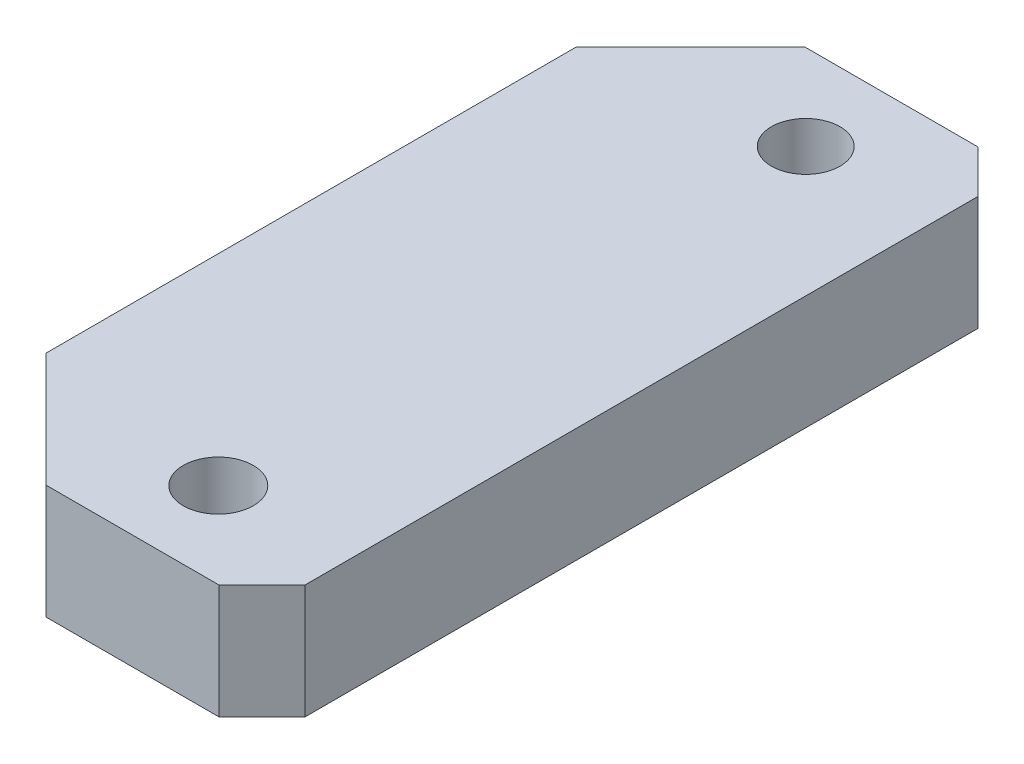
ISO-10303-21;
HEADER;
FILE_DESCRIPTION(('STEP AP214'),'2;1');
FILE_NAME('part.step','',(''),(''),'','','');
FILE_SCHEMA(('AUTOMOTIVE_DESIGN { 1 0 10303 214 1 1 1 1 }'));
ENDSEC;
DATA;
#1=APPLICATION_CONTEXT('core data for automotive mechanical design processes');
#2=APPLICATION_PROTOCOL_DEFINITION('international standard','automotive_design',2000,#1);
#3=PRODUCT_CONTEXT('',#1,'mechanical');
#4=PRODUCT('Part','Part','',(#3));
#5=PRODUCT_RELATED_PRODUCT_CATEGORY('part','',(#4));
#6=PRODUCT_DEFINITION_FORMATION('','',#4);
#7=PRODUCT_DEFINITION_CONTEXT('part definition',#1,'design');
#8=PRODUCT_DEFINITION('design','',#6,#7);
#9=PRODUCT_DEFINITION_SHAPE('','',#8);
#10=(LENGTH_UNIT() NAMED_UNIT(*) SI_UNIT(.MILLI.,.METRE.));
#11=(NAMED_UNIT(*) PLANE_ANGLE_UNIT() SI_UNIT($,.RADIAN.));
#12=(NAMED_UNIT(*) SI_UNIT($,.STERADIAN.) SOLID_ANGLE_UNIT());
#13=UNCERTAINTY_MEASURE_WITH_UNIT(LENGTH_MEASURE(1.E-05),#10,'distance_accuracy_value','');
#14=(GEOMETRIC_REPRESENTATION_CONTEXT(3) GLOBAL_UNCERTAINTY_ASSIGNED_CONTEXT((#13)) GLOBAL_UNIT_ASSIGNED_CONTEXT((#10,
#11,#12)) REPRESENTATION_CONTEXT('',''));
#15=CARTESIAN_POINT('',(0.,0.,0.));
#16=DIRECTION('',(0.,0.,1.));
#17=DIRECTION('',(1.,0.,0.));
#18=AXIS2_PLACEMENT_3D('',#15,#16,#17);
#19=CARTESIAN_POINT('',(-37.72,-4.,-13.28));
#20=DIRECTION('',(0.,0.,-1.));
#21=DIRECTION('',(-1.,0.,0.));
#22=AXIS2_PLACEMENT_3D('',#19,#20,#21);
#23=PLANE('',#22);
#24=DIRECTION('',(-1.,0.,0.));
#25=VECTOR('',#24,1.);
#26=CARTESIAN_POINT('',(-37.72,0.,-13.28));
#27=LINE('',#26,#25);
#28=CARTESIAN_POINT('',(-37.72,0.,-13.28));
#29=VERTEX_POINT('',#28);
#30=CARTESIAN_POINT('',(-43.78,0.,-13.28));
#31=VERTEX_POINT('',#30);
#32=EDGE_CURVE('E130',#29,#31,#27,.T.);
#33=ORIENTED_EDGE('',*,*,#32,.F.);
#34=DIRECTION('',(0.,1.,0.));
#35=VECTOR('',#34,1.);
#36=CARTESIAN_POINT('',(-37.72,-4.,-13.28));
#37=LINE('',#36,#35);
#38=CARTESIAN_POINT('',(-37.72,-4.,-13.28));
#39=VERTEX_POINT('',#38);
#40=EDGE_CURVE('E11',#39,#29,#37,.T.);
#41=ORIENTED_EDGE('',*,*,#40,.F.);
#42=DIRECTION('',(-1.,0.,0.));
#43=VECTOR('',#42,1.);
#44=CARTESIAN_POINT('',(-37.72,-4.,-13.28));
#45=LINE('',#44,#43);
#46=CARTESIAN_POINT('',(-43.78,-4.,-13.28));
#47=VERTEX_POINT('',#46);
#48=EDGE_CURVE('E151',#39,#47,#45,.T.);
#49=ORIENTED_EDGE('',*,*,#48,.T.);
#50=DIRECTION('',(0.,1.,0.));
#51=VECTOR('',#50,1.);
#52=CARTESIAN_POINT('',(-43.78,-4.,-13.28));
#53=LINE('',#52,#51);
#54=EDGE_CURVE('E36',#47,#31,#53,.T.);
#55=ORIENTED_EDGE('',*,*,#54,.T.);
#56=EDGE_LOOP('',(#33,#41,#49,#55));
#57=FACE_BOUND('',#56,.T.);
#58=ADVANCED_FACE('F33',(#57),#23,.T.);
#59=CARTESIAN_POINT('',(-36.22,-4.,-11.78));
#60=DIRECTION('',(0.707106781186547,0.,-0.707106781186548));
#61=DIRECTION('',(-0.707106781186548,0.,-0.707106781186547));
#62=AXIS2_PLACEMENT_3D('',#59,#60,#61);
#63=PLANE('',#62);
#64=DIRECTION('',(-0.707106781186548,0.,-0.707106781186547));
#65=VECTOR('',#64,1.);
#66=CARTESIAN_POINT('',(-36.22,0.,-11.78));
#67=LINE('',#66,#65);
#68=CARTESIAN_POINT('',(-36.22,0.,-11.78));
#69=VERTEX_POINT('',#68);
#70=EDGE_CURVE('E149',#69,#29,#67,.T.);
#71=ORIENTED_EDGE('',*,*,#70,.F.);
#72=DIRECTION('',(0.,1.,0.));
#73=VECTOR('',#72,1.);
#74=CARTESIAN_POINT('',(-36.22,-4.,-11.78));
#75=LINE('',#74,#73);
#76=CARTESIAN_POINT('',(-36.22,-4.,-11.78));
#77=VERTEX_POINT('',#76);
#78=EDGE_CURVE('E42',#77,#69,#75,.T.);
#79=ORIENTED_EDGE('',*,*,#78,.F.);
#80=DIRECTION('',(-0.707106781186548,0.,-0.707106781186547));
#81=VECTOR('',#80,1.);
#82=CARTESIAN_POINT('',(-36.22,-4.,-11.78));
#83=LINE('',#82,#81);
#84=EDGE_CURVE('E120',#77,#39,#83,.T.);
#85=ORIENTED_EDGE('',*,*,#84,.T.);
#86=ORIENTED_EDGE('',*,*,#40,.T.);
#87=EDGE_LOOP('',(#71,#79,#85,#86));
#88=FACE_BOUND('',#87,.T.);
#89=ADVANCED_FACE('F163',(#88),#63,.T.);
#90=CARTESIAN_POINT('',(-36.22,-4.,11.78));
#91=DIRECTION('',(1.,0.,0.));
#92=DIRECTION('',(0.,0.,-1.));
#93=AXIS2_PLACEMENT_3D('',#90,#91,#92);
#94=PLANE('',#93);
#95=DIRECTION('',(0.,0.,-1.));
#96=VECTOR('',#95,1.);
#97=CARTESIAN_POINT('',(-36.22,0.,11.78));
#98=LINE('',#97,#96);
#99=CARTESIAN_POINT('',(-36.22,0.,11.78));
#100=VERTEX_POINT('',#99);
#101=EDGE_CURVE('E107',#100,#69,#98,.T.);
#102=ORIENTED_EDGE('',*,*,#101,.F.);
#103=DIRECTION('',(0.,1.,0.));
#104=VECTOR('',#103,1.);
#105=CARTESIAN_POINT('',(-36.22,-4.,11.78));
#106=LINE('',#105,#104);
#107=CARTESIAN_POINT('',(-36.22,-4.,11.78));
#108=VERTEX_POINT('',#107);
#109=EDGE_CURVE('E102',#108,#100,#106,.T.);
#110=ORIENTED_EDGE('',*,*,#109,.F.);
#111=DIRECTION('',(0.,0.,-1.));
#112=VECTOR('',#111,1.);
#113=CARTESIAN_POINT('',(-36.22,-4.,11.78));
#114=LINE('',#113,#112);
#115=EDGE_CURVE('E105',#108,#77,#114,.T.);
#116=ORIENTED_EDGE('',*,*,#115,.T.);
#117=ORIENTED_EDGE('',*,*,#78,.T.);
#118=EDGE_LOOP('',(#102,#110,#116,#117));
#119=FACE_BOUND('',#118,.T.);
#120=ADVANCED_FACE('F104',(#119),#94,.T.);
#121=CARTESIAN_POINT('',(-37.72,-4.,13.28));
#122=DIRECTION('',(0.707106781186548,0.,0.707106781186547));
#123=DIRECTION('',(0.707106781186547,0.,-0.707106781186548));
#124=AXIS2_PLACEMENT_3D('',#121,#122,#123);
#125=PLANE('',#124);
#126=DIRECTION('',(0.707106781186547,0.,-0.707106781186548));
#127=VECTOR('',#126,1.);
#128=CARTESIAN_POINT('',(-37.72,0.,13.28));
#129=LINE('',#128,#127);
#130=CARTESIAN_POINT('',(-37.72,0.,13.28));
#131=VERTEX_POINT('',#130);
#132=EDGE_CURVE('E146',#131,#100,#129,.T.);
#133=ORIENTED_EDGE('',*,*,#132,.F.);
#134=DIRECTION('',(0.,1.,0.));
#135=VECTOR('',#134,1.);
#136=CARTESIAN_POINT('',(-37.72,-4.,13.28));
#137=LINE('',#136,#135);
#138=CARTESIAN_POINT('',(-37.72,-4.,13.28));
#139=VERTEX_POINT('',#138);
#140=EDGE_CURVE('E112',#139,#131,#137,.T.);
#141=ORIENTED_EDGE('',*,*,#140,.F.);
#142=DIRECTION('',(0.707106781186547,0.,-0.707106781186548));
#143=VECTOR('',#142,1.);
#144=CARTESIAN_POINT('',(-37.72,-4.,13.28));
#145=LINE('',#144,#143);
#146=EDGE_CURVE('E118',#139,#108,#145,.T.);
#147=ORIENTED_EDGE('',*,*,#146,.T.);
#148=ORIENTED_EDGE('',*,*,#109,.T.);
#149=EDGE_LOOP('',(#133,#141,#147,#148));
#150=FACE_BOUND('',#149,.T.);
#151=ADVANCED_FACE('F122',(#150),#125,.T.);
#152=CARTESIAN_POINT('',(-37.72,-4.,13.28));
#153=DIRECTION('',(0.,0.,1.));
#154=DIRECTION('',(1.,0.,0.));
#155=AXIS2_PLACEMENT_3D('',#152,#153,#154);
#156=PLANE('',#155);
#157=DIRECTION('',(1.,0.,0.));
#158=VECTOR('',#157,1.);
#159=CARTESIAN_POINT('',(-37.72,0.,13.28));
#160=LINE('',#159,#158);
#161=CARTESIAN_POINT('',(-43.78,0.,13.28));
#162=VERTEX_POINT('',#161);
#163=EDGE_CURVE('E143',#162,#131,#160,.T.);
#164=ORIENTED_EDGE('',*,*,#163,.F.);
#165=DIRECTION('',(0.,1.,0.));
#166=VECTOR('',#165,1.);
#167=CARTESIAN_POINT('',(-43.78,-4.,13.28));
#168=LINE('',#167,#166);
#169=CARTESIAN_POINT('',(-43.78,-4.,13.28));
#170=VERTEX_POINT('',#169);
#171=EDGE_CURVE('E155',#170,#162,#168,.T.);
#172=ORIENTED_EDGE('',*,*,#171,.F.);
#173=DIRECTION('',(1.,0.,0.));
#174=VECTOR('',#173,1.);
#175=CARTESIAN_POINT('',(-37.72,-4.,13.28));
#176=LINE('',#175,#174);
#177=EDGE_CURVE('E123',#170,#139,#176,.T.);
#178=ORIENTED_EDGE('',*,*,#177,.T.);
#179=ORIENTED_EDGE('',*,*,#140,.T.);
#180=EDGE_LOOP('',(#164,#172,#178,#179));
#181=FACE_BOUND('',#180,.T.);
#182=ADVANCED_FACE('F176',(#181),#156,.T.);
#183=CARTESIAN_POINT('',(-43.78,-4.,13.28));
#184=DIRECTION('',(-0.707106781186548,0.,0.707106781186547));
#185=DIRECTION('',(0.707106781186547,0.,0.707106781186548));
#186=AXIS2_PLACEMENT_3D('',#183,#184,#185);
#187=PLANE('',#186);
#188=DIRECTION('',(0.707106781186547,0.,0.707106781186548));
#189=VECTOR('',#188,1.);
#190=CARTESIAN_POINT('',(-43.78,0.,13.28));
#191=LINE('',#190,#189);
#192=CARTESIAN_POINT('',(-47.78,0.,9.28000000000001));
#193=VERTEX_POINT('',#192);
#194=EDGE_CURVE('E140',#193,#162,#191,.T.);
#195=ORIENTED_EDGE('',*,*,#194,.F.);
#196=DIRECTION('',(0.,1.,0.));
#197=VECTOR('',#196,1.);
#198=CARTESIAN_POINT('',(-47.78,-4.,9.28000000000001));
#199=LINE('',#198,#197);
#200=CARTESIAN_POINT('',(-47.78,-4.,9.28000000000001));
#201=VERTEX_POINT('',#200);
#202=EDGE_CURVE('E157',#201,#193,#199,.T.);
#203=ORIENTED_EDGE('',*,*,#202,.F.);
#204=DIRECTION('',(0.707106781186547,0.,0.707106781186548));
#205=VECTOR('',#204,1.);
#206=CARTESIAN_POINT('',(-43.78,-4.,13.28));
#207=LINE('',#206,#205);
#208=EDGE_CURVE('E125',#201,#170,#207,.T.);
#209=ORIENTED_EDGE('',*,*,#208,.T.);
#210=ORIENTED_EDGE('',*,*,#171,.T.);
#211=EDGE_LOOP('',(#195,#203,#209,#210));
#212=FACE_BOUND('',#211,.T.);
#213=ADVANCED_FACE('F179',(#212),#187,.T.);
#214=CARTESIAN_POINT('',(-47.78,-4.,9.28000000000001));
#215=DIRECTION('',(-1.,0.,0.));
#216=DIRECTION('',(0.,0.,1.));
#217=AXIS2_PLACEMENT_3D('',#214,#215,#216);
#218=PLANE('',#217);
#219=DIRECTION('',(0.,0.,1.));
#220=VECTOR('',#219,1.);
#221=CARTESIAN_POINT('',(-47.78,0.,9.28000000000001));
#222=LINE('',#221,#220);
#223=CARTESIAN_POINT('',(-47.78,0.,-9.28000000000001));
#224=VERTEX_POINT('',#223);
#225=EDGE_CURVE('E137',#224,#193,#222,.T.);
#226=ORIENTED_EDGE('',*,*,#225,.F.);
#227=DIRECTION('',(0.,1.,0.));
#228=VECTOR('',#227,1.);
#229=CARTESIAN_POINT('',(-47.78,-4.,-9.28000000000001));
#230=LINE('',#229,#228);
#231=CARTESIAN_POINT('',(-47.78,-4.,-9.28000000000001));
#232=VERTEX_POINT('',#231);
#233=EDGE_CURVE('E158',#232,#224,#230,.T.);
#234=ORIENTED_EDGE('',*,*,#233,.F.);
#235=DIRECTION('',(0.,0.,1.));
#236=VECTOR('',#235,1.);
#237=CARTESIAN_POINT('',(-47.78,-4.,9.28000000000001));
#238=LINE('',#237,#236);
#239=EDGE_CURVE('E225',#232,#201,#238,.T.);
#240=ORIENTED_EDGE('',*,*,#239,.T.);
#241=ORIENTED_EDGE('',*,*,#202,.T.);
#242=EDGE_LOOP('',(#226,#234,#240,#241));
#243=FACE_BOUND('',#242,.T.);
#244=ADVANCED_FACE('F183',(#243),#218,.T.);
#245=CARTESIAN_POINT('',(-47.78,-4.,-9.28000000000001));
#246=DIRECTION('',(-0.707106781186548,0.,-0.707106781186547));
#247=DIRECTION('',(-0.707106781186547,0.,0.707106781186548));
#248=AXIS2_PLACEMENT_3D('',#245,#246,#247);
#249=PLANE('',#248);
#250=DIRECTION('',(-0.707106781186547,0.,0.707106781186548));
#251=VECTOR('',#250,1.);
#252=CARTESIAN_POINT('',(-47.78,0.,-9.28000000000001));
#253=LINE('',#252,#251);
#254=EDGE_CURVE('E133',#31,#224,#253,.T.);
#255=ORIENTED_EDGE('',*,*,#254,.F.);
#256=ORIENTED_EDGE('',*,*,#54,.F.);
#257=DIRECTION('',(-0.707106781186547,0.,0.707106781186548));
#258=VECTOR('',#257,1.);
#259=CARTESIAN_POINT('',(-47.78,-4.,-9.28000000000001));
#260=LINE('',#259,#258);
#261=EDGE_CURVE('E223',#47,#232,#260,.T.);
#262=ORIENTED_EDGE('',*,*,#261,.T.);
#263=ORIENTED_EDGE('',*,*,#233,.T.);
#264=EDGE_LOOP('',(#255,#256,#262,#263));
#265=FACE_BOUND('',#264,.T.);
#266=ADVANCED_FACE('F160',(#265),#249,.T.);
#267=CARTESIAN_POINT('',(0.,-4.,0.));
#268=DIRECTION('',(0.,-1.,0.));
#269=DIRECTION('',(0.,0.,-1.));
#270=AXIS2_PLACEMENT_3D('',#267,#268,#269);
#271=PLANE('',#270);
#272=CARTESIAN_POINT('',(-40.75,-4.,-10.28));
#273=DIRECTION('',(0.,1.,0.));
#274=DIRECTION('',(0.,0.,1.));
#275=AXIS2_PLACEMENT_3D('',#272,#273,#274);
#276=CIRCLE('',#275,1.2);
#277=CARTESIAN_POINT('',(-40.75,-4.,-9.08000000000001));
#278=VERTEX_POINT('',#277);
#279=EDGE_CURVE('E210',#278,#278,#276,.T.);
#280=ORIENTED_EDGE('',*,*,#279,.T.);
#281=EDGE_LOOP('',(#280));
#282=FACE_BOUND('',#281,.T.);
#283=CARTESIAN_POINT('',(-40.75,-4.,10.28));
#284=DIRECTION('',(0.,1.,0.));
#285=DIRECTION('',(0.,0.,1.));
#286=AXIS2_PLACEMENT_3D('',#283,#284,#285);
#287=CIRCLE('',#286,1.22549312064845);
#288=CARTESIAN_POINT('',(-40.75,-4.,11.5054931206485));
#289=VERTEX_POINT('',#288);
#290=EDGE_CURVE('E134',#289,#289,#287,.T.);
#291=ORIENTED_EDGE('',*,*,#290,.T.);
#292=EDGE_LOOP('',(#291));
#293=FACE_BOUND('',#292,.T.);
#294=ORIENTED_EDGE('',*,*,#48,.F.);
#295=ORIENTED_EDGE('',*,*,#84,.F.);
#296=ORIENTED_EDGE('',*,*,#115,.F.);
#297=ORIENTED_EDGE('',*,*,#146,.F.);
#298=ORIENTED_EDGE('',*,*,#177,.F.);
#299=ORIENTED_EDGE('',*,*,#208,.F.);
#300=ORIENTED_EDGE('',*,*,#239,.F.);
#301=ORIENTED_EDGE('',*,*,#261,.F.);
#302=EDGE_LOOP('',(#294,#295,#296,#297,#298,#299,#300,#301));
#303=FACE_BOUND('',#302,.T.);
#304=ADVANCED_FACE('F116',(#282,#293,#303),#271,.T.);
#305=CARTESIAN_POINT('',(0.,0.,0.));
#306=DIRECTION('',(0.,-1.,0.));
#307=DIRECTION('',(0.,0.,-1.));
#308=AXIS2_PLACEMENT_3D('',#305,#306,#307);
#309=PLANE('',#308);
#310=CARTESIAN_POINT('',(-40.75,0.,-10.28));
#311=DIRECTION('',(0.,1.,0.));
#312=DIRECTION('',(0.,0.,1.));
#313=AXIS2_PLACEMENT_3D('',#310,#311,#312);
#314=CIRCLE('',#313,1.2);
#315=CARTESIAN_POINT('',(-40.75,0.,-9.08000000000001));
#316=VERTEX_POINT('',#315);
#317=EDGE_CURVE('E213',#316,#316,#314,.T.);
#318=ORIENTED_EDGE('',*,*,#317,.F.);
#319=EDGE_LOOP('',(#318));
#320=FACE_BOUND('',#319,.T.);
#321=CARTESIAN_POINT('',(-40.75,0.,10.28));
#322=DIRECTION('',(0.,1.,0.));
#323=DIRECTION('',(0.,0.,1.));
#324=AXIS2_PLACEMENT_3D('',#321,#322,#323);
#325=CIRCLE('',#324,1.22549312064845);
#326=CARTESIAN_POINT('',(-40.75,0.,11.5054931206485));
#327=VERTEX_POINT('',#326);
#328=EDGE_CURVE('E215',#327,#327,#325,.T.);
#329=ORIENTED_EDGE('',*,*,#328,.F.);
#330=EDGE_LOOP('',(#329));
#331=FACE_BOUND('',#330,.T.);
#332=ORIENTED_EDGE('',*,*,#32,.T.);
#333=ORIENTED_EDGE('',*,*,#254,.T.);
#334=ORIENTED_EDGE('',*,*,#225,.T.);
#335=ORIENTED_EDGE('',*,*,#194,.T.);
#336=ORIENTED_EDGE('',*,*,#163,.T.);
#337=ORIENTED_EDGE('',*,*,#132,.T.);
#338=ORIENTED_EDGE('',*,*,#101,.T.);
#339=ORIENTED_EDGE('',*,*,#70,.T.);
#340=EDGE_LOOP('',(#332,#333,#334,#335,#336,#337,#338,#339));
#341=FACE_BOUND('',#340,.T.);
#342=ADVANCED_FACE('F162',(#320,#331,#341),#309,.F.);
#343=CARTESIAN_POINT('',(-40.75,-4.,10.28));
#344=DIRECTION('',(0.,1.,0.));
#345=DIRECTION('',(0.,0.,1.));
#346=AXIS2_PLACEMENT_3D('',#343,#344,#345);
#347=CYLINDRICAL_SURFACE('',#346,1.22549312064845);
#348=ORIENTED_EDGE('',*,*,#290,.F.);
#349=EDGE_LOOP('',(#348));
#350=FACE_BOUND('',#349,.T.);
#351=ORIENTED_EDGE('',*,*,#328,.T.);
#352=EDGE_LOOP('',(#351));
#353=FACE_BOUND('',#352,.T.);
#354=ADVANCED_FACE('F195',(#350,#353),#347,.F.);
#355=CARTESIAN_POINT('',(-40.75,-4.,-10.28));
#356=DIRECTION('',(0.,1.,0.));
#357=DIRECTION('',(0.,0.,1.));
#358=AXIS2_PLACEMENT_3D('',#355,#356,#357);
#359=CYLINDRICAL_SURFACE('',#358,1.2);
#360=ORIENTED_EDGE('',*,*,#279,.F.);
#361=EDGE_LOOP('',(#360));
#362=FACE_BOUND('',#361,.T.);
#363=ORIENTED_EDGE('',*,*,#317,.T.);
#364=EDGE_LOOP('',(#363));
#365=FACE_BOUND('',#364,.T.);
#366=ADVANCED_FACE('F202',(#362,#365),#359,.F.);
#367=CLOSED_SHELL('',(#58,#89,#120,#151,#182,#213,#244,#266,#304,#342,#354,#366));
#368=MANIFOLD_SOLID_BREP('B2',#367);
#369=ADVANCED_BREP_SHAPE_REPRESENTATION('',(#18,#368),#14);
#370=SHAPE_DEFINITION_REPRESENTATION(#9,#369);
ENDSEC;
END-ISO-10303-21;
